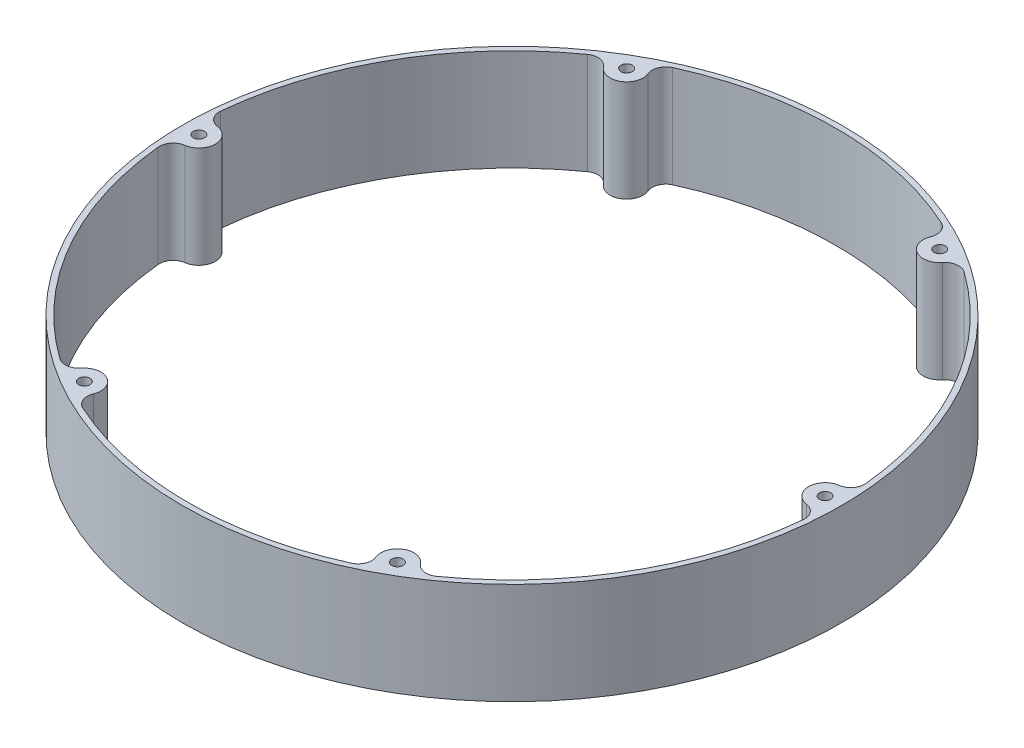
ISO-10303-21;
HEADER;
FILE_DESCRIPTION(('STEP AP214'),'2;1');
FILE_NAME('part.step','',(''),(''),'','','');
FILE_SCHEMA(('AUTOMOTIVE_DESIGN { 1 0 10303 214 1 1 1 1 }'));
ENDSEC;
DATA;
#1=APPLICATION_CONTEXT('core data for automotive mechanical design processes');
#2=APPLICATION_PROTOCOL_DEFINITION('international standard','automotive_design',2000,#1);
#3=PRODUCT_CONTEXT('',#1,'mechanical');
#4=PRODUCT('Part','Part','',(#3));
#5=PRODUCT_RELATED_PRODUCT_CATEGORY('part','',(#4));
#6=PRODUCT_DEFINITION_FORMATION('','',#4);
#7=PRODUCT_DEFINITION_CONTEXT('part definition',#1,'design');
#8=PRODUCT_DEFINITION('design','',#6,#7);
#9=PRODUCT_DEFINITION_SHAPE('','',#8);
#10=(LENGTH_UNIT() NAMED_UNIT(*) SI_UNIT(.MILLI.,.METRE.));
#11=(NAMED_UNIT(*) PLANE_ANGLE_UNIT() SI_UNIT($,.RADIAN.));
#12=(NAMED_UNIT(*) SI_UNIT($,.STERADIAN.) SOLID_ANGLE_UNIT());
#13=UNCERTAINTY_MEASURE_WITH_UNIT(LENGTH_MEASURE(1.E-05),#10,'distance_accuracy_value','');
#14=(GEOMETRIC_REPRESENTATION_CONTEXT(3) GLOBAL_UNCERTAINTY_ASSIGNED_CONTEXT((#13)) GLOBAL_UNIT_ASSIGNED_CONTEXT((#10,
#11,#12)) REPRESENTATION_CONTEXT('',''));
#15=CARTESIAN_POINT('',(0.,0.,0.));
#16=DIRECTION('',(0.,0.,1.));
#17=DIRECTION('',(1.,0.,0.));
#18=AXIS2_PLACEMENT_3D('',#15,#16,#17);
#19=CARTESIAN_POINT('',(0.,18.5,0.));
#20=DIRECTION('',(0.,1.,0.));
#21=DIRECTION('',(0.,0.,1.));
#22=AXIS2_PLACEMENT_3D('',#19,#20,#21);
#23=PLANE('',#22);
#24=CARTESIAN_POINT('',(28.5,18.5,49.363448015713));
#25=DIRECTION('',(0.,-1.,0.));
#26=DIRECTION('',(0.,0.,-1.));
#27=AXIS2_PLACEMENT_3D('',#24,#25,#26);
#28=CIRCLE('',#27,1.02499999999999);
#29=CARTESIAN_POINT('',(28.5,18.5,48.338448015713));
#30=VERTEX_POINT('',#29);
#31=EDGE_CURVE('E480',#30,#30,#28,.T.);
#32=ORIENTED_EDGE('',*,*,#31,.T.);
#33=EDGE_LOOP('',(#32));
#34=FACE_BOUND('',#33,.T.);
#35=CARTESIAN_POINT('',(-28.5,18.5,49.363448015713));
#36=DIRECTION('',(0.,-1.,0.));
#37=DIRECTION('',(0.,0.,-1.));
#38=AXIS2_PLACEMENT_3D('',#35,#36,#37);
#39=CIRCLE('',#38,1.02499999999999);
#40=CARTESIAN_POINT('',(-28.5,18.5,48.338448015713));
#41=VERTEX_POINT('',#40);
#42=EDGE_CURVE('E489',#41,#41,#39,.T.);
#43=ORIENTED_EDGE('',*,*,#42,.T.);
#44=EDGE_LOOP('',(#43));
#45=FACE_BOUND('',#44,.T.);
#46=CARTESIAN_POINT('',(57.,18.5,0.));
#47=DIRECTION('',(0.,-1.,0.));
#48=DIRECTION('',(0.,0.,-1.));
#49=AXIS2_PLACEMENT_3D('',#46,#47,#48);
#50=CIRCLE('',#49,1.025);
#51=CARTESIAN_POINT('',(57.,18.5,-1.02500000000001));
#52=VERTEX_POINT('',#51);
#53=EDGE_CURVE('E513',#52,#52,#50,.T.);
#54=ORIENTED_EDGE('',*,*,#53,.T.);
#55=EDGE_LOOP('',(#54));
#56=FACE_BOUND('',#55,.T.);
#57=CARTESIAN_POINT('',(0.,18.5,0.));
#58=DIRECTION('',(0.,1.,0.));
#59=DIRECTION('',(0.,0.,1.));
#60=AXIS2_PLACEMENT_3D('',#57,#58,#59);
#61=CIRCLE('',#60,60.);
#62=CARTESIAN_POINT('',(0.,18.5,60.));
#63=VERTEX_POINT('',#62);
#64=EDGE_CURVE('E225',#63,#63,#61,.T.);
#65=ORIENTED_EDGE('',*,*,#64,.T.);
#66=EDGE_LOOP('',(#65));
#67=FACE_BOUND('',#66,.T.);
#68=CARTESIAN_POINT('',(0.,18.5,0.));
#69=DIRECTION('',(0.,1.,0.));
#70=DIRECTION('',(0.,0.,1.));
#71=AXIS2_PLACEMENT_3D('',#68,#69,#70);
#72=CIRCLE('',#71,59.);
#73=CARTESIAN_POINT('',(-24.4368153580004,18.5,53.7014157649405));
#74=VERTEX_POINT('',#73);
#75=CARTESIAN_POINT('',(24.4368153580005,18.5,53.7014157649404));
#76=VERTEX_POINT('',#75);
#77=EDGE_CURVE('E361',#74,#76,#72,.T.);
#78=ORIENTED_EDGE('',*,*,#77,.F.);
#79=CARTESIAN_POINT('',(-23.401357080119,18.5,51.4259320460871));
#80=DIRECTION('',(0.,1.,0.));
#81=DIRECTION('',(0.,0.,1.));
#82=AXIS2_PLACEMENT_3D('',#79,#80,#81);
#83=CIRCLE('',#82,2.5);
#84=CARTESIAN_POINT('',(-25.7189220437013,18.5,50.488439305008));
#85=VERTEX_POINT('',#84);
#86=EDGE_CURVE('E60',#74,#85,#83,.F.);
#87=ORIENTED_EDGE('',*,*,#86,.T.);
#88=CARTESIAN_POINT('',(-28.5,18.5,49.363448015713));
#89=DIRECTION('',(0.,1.,0.));
#90=DIRECTION('',(0.,0.,1.));
#91=AXIS2_PLACEMENT_3D('',#88,#89,#90);
#92=CIRCLE('',#91,3.00000000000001);
#93=CARTESIAN_POINT('',(-30.8648100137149,18.5,47.5174595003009));
#94=VERTEX_POINT('',#93);
#95=EDGE_CURVE('E516',#85,#94,#92,.T.);
#96=ORIENTED_EDGE('',*,*,#95,.T.);
#97=CARTESIAN_POINT('',(-32.8354850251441,18.5,45.9791357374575));
#98=DIRECTION('',(0.,1.,0.));
#99=DIRECTION('',(0.,0.,1.));
#100=AXIS2_PLACEMENT_3D('',#97,#98,#99);
#101=CIRCLE('',#100,2.5);
#102=CARTESIAN_POINT('',(-34.2883825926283,18.5,48.0136107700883));
#103=VERTEX_POINT('',#102);
#104=EDGE_CURVE('E52',#94,#103,#101,.F.);
#105=ORIENTED_EDGE('',*,*,#104,.T.);
#106=CARTESIAN_POINT('',(-58.7251979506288,18.5,5.68780499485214));
#107=VERTEX_POINT('',#106);
#108=EDGE_CURVE('E364',#107,#103,#72,.T.);
#109=ORIENTED_EDGE('',*,*,#108,.F.);
#110=CARTESIAN_POINT('',(-56.2368421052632,18.5,5.44679630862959));
#111=DIRECTION('',(0.,1.,0.));
#112=DIRECTION('',(0.,0.,1.));
#113=AXIS2_PLACEMENT_3D('',#110,#111,#112);
#114=CIRCLE('',#113,2.5);
#115=CARTESIAN_POINT('',(-56.5837320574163,18.5,2.97097980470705));
#116=VERTEX_POINT('',#115);
#117=EDGE_CURVE('E288',#107,#116,#114,.F.);
#118=ORIENTED_EDGE('',*,*,#117,.T.);
#119=CARTESIAN_POINT('',(-57.,18.5,0.));
#120=DIRECTION('',(0.,1.,0.));
#121=DIRECTION('',(0.,0.,1.));
#122=AXIS2_PLACEMENT_3D('',#119,#120,#121);
#123=CIRCLE('',#122,3.00000000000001);
#124=CARTESIAN_POINT('',(-56.5837320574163,18.5,-2.97097980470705));
#125=VERTEX_POINT('',#124);
#126=EDGE_CURVE('E222',#116,#125,#123,.T.);
#127=ORIENTED_EDGE('',*,*,#126,.T.);
#128=CARTESIAN_POINT('',(-56.2368421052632,18.5,-5.44679630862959));
#129=DIRECTION('',(0.,1.,0.));
#130=DIRECTION('',(0.,0.,1.));
#131=AXIS2_PLACEMENT_3D('',#128,#129,#130);
#132=CIRCLE('',#131,2.5);
#133=CARTESIAN_POINT('',(-58.7251979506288,18.5,-5.68780499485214));
#134=VERTEX_POINT('',#133);
#135=EDGE_CURVE('E211',#125,#134,#132,.F.);
#136=ORIENTED_EDGE('',*,*,#135,.T.);
#137=CARTESIAN_POINT('',(-34.2883825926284,18.5,-48.0136107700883));
#138=VERTEX_POINT('',#137);
#139=EDGE_CURVE('E372',#138,#134,#72,.T.);
#140=ORIENTED_EDGE('',*,*,#139,.F.);
#141=CARTESIAN_POINT('',(-32.8354850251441,18.5,-45.9791357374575));
#142=DIRECTION('',(0.,1.,0.));
#143=DIRECTION('',(0.,0.,1.));
#144=AXIS2_PLACEMENT_3D('',#141,#142,#143);
#145=CIRCLE('',#144,2.5);
#146=CARTESIAN_POINT('',(-30.864810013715,18.5,-47.5174595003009));
#147=VERTEX_POINT('',#146);
#148=EDGE_CURVE('E292',#138,#147,#145,.F.);
#149=ORIENTED_EDGE('',*,*,#148,.T.);
#150=CARTESIAN_POINT('',(-28.5,18.5,-49.363448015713));
#151=DIRECTION('',(0.,1.,0.));
#152=DIRECTION('',(0.,0.,1.));
#153=AXIS2_PLACEMENT_3D('',#150,#151,#152);
#154=CIRCLE('',#153,3.);
#155=CARTESIAN_POINT('',(-25.7189220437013,18.5,-50.4884393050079));
#156=VERTEX_POINT('',#155);
#157=EDGE_CURVE('E350',#147,#156,#154,.T.);
#158=ORIENTED_EDGE('',*,*,#157,.T.);
#159=CARTESIAN_POINT('',(-23.4013570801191,18.5,-51.425932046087));
#160=DIRECTION('',(0.,1.,0.));
#161=DIRECTION('',(0.,0.,1.));
#162=AXIS2_PLACEMENT_3D('',#159,#160,#161);
#163=CIRCLE('',#162,2.5);
#164=CARTESIAN_POINT('',(-24.4368153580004,18.5,-53.7014157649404));
#165=VERTEX_POINT('',#164);
#166=EDGE_CURVE('E294',#156,#165,#163,.F.);
#167=ORIENTED_EDGE('',*,*,#166,.T.);
#168=CARTESIAN_POINT('',(24.4368153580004,18.5,-53.7014157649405));
#169=VERTEX_POINT('',#168);
#170=EDGE_CURVE('E340',#169,#165,#72,.T.);
#171=ORIENTED_EDGE('',*,*,#170,.F.);
#172=CARTESIAN_POINT('',(23.401357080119,18.5,-51.425932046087));
#173=DIRECTION('',(0.,1.,0.));
#174=DIRECTION('',(0.,0.,1.));
#175=AXIS2_PLACEMENT_3D('',#172,#173,#174);
#176=CIRCLE('',#175,2.5);
#177=CARTESIAN_POINT('',(25.7189220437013,18.5,-50.4884393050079));
#178=VERTEX_POINT('',#177);
#179=EDGE_CURVE('E300',#169,#178,#176,.F.);
#180=ORIENTED_EDGE('',*,*,#179,.T.);
#181=CARTESIAN_POINT('',(28.5,18.5,-49.363448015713));
#182=DIRECTION('',(0.,1.,0.));
#183=DIRECTION('',(0.,0.,1.));
#184=AXIS2_PLACEMENT_3D('',#181,#182,#183);
#185=CIRCLE('',#184,3.);
#186=CARTESIAN_POINT('',(30.864810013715,18.5,-47.5174595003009));
#187=VERTEX_POINT('',#186);
#188=EDGE_CURVE('E330',#178,#187,#185,.T.);
#189=ORIENTED_EDGE('',*,*,#188,.T.);
#190=CARTESIAN_POINT('',(32.8354850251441,18.5,-45.9791357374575));
#191=DIRECTION('',(0.,1.,0.));
#192=DIRECTION('',(0.,0.,1.));
#193=AXIS2_PLACEMENT_3D('',#190,#191,#192);
#194=CIRCLE('',#193,2.5);
#195=CARTESIAN_POINT('',(34.2883825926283,18.5,-48.0136107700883));
#196=VERTEX_POINT('',#195);
#197=EDGE_CURVE('E45',#187,#196,#194,.F.);
#198=ORIENTED_EDGE('',*,*,#197,.T.);
#199=CARTESIAN_POINT('',(58.7251979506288,18.5,-5.68780499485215));
#200=VERTEX_POINT('',#199);
#201=EDGE_CURVE('E327',#200,#196,#72,.T.);
#202=ORIENTED_EDGE('',*,*,#201,.F.);
#203=CARTESIAN_POINT('',(56.2368421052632,18.5,-5.4467963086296));
#204=DIRECTION('',(0.,1.,0.));
#205=DIRECTION('',(0.,0.,1.));
#206=AXIS2_PLACEMENT_3D('',#203,#204,#205);
#207=CIRCLE('',#206,2.5);
#208=CARTESIAN_POINT('',(56.5837320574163,18.5,-2.97097980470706));
#209=VERTEX_POINT('',#208);
#210=EDGE_CURVE('E304',#200,#209,#207,.F.);
#211=ORIENTED_EDGE('',*,*,#210,.T.);
#212=CARTESIAN_POINT('',(57.,18.5,0.));
#213=DIRECTION('',(0.,1.,0.));
#214=DIRECTION('',(0.,0.,1.));
#215=AXIS2_PLACEMENT_3D('',#212,#213,#214);
#216=CIRCLE('',#215,3.00000000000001);
#217=CARTESIAN_POINT('',(56.5837320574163,18.5,2.97097980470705));
#218=VERTEX_POINT('',#217);
#219=EDGE_CURVE('E527',#209,#218,#216,.T.);
#220=ORIENTED_EDGE('',*,*,#219,.T.);
#221=CARTESIAN_POINT('',(56.2368421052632,18.5,5.44679630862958));
#222=DIRECTION('',(0.,1.,0.));
#223=DIRECTION('',(0.,0.,1.));
#224=AXIS2_PLACEMENT_3D('',#221,#222,#223);
#225=CIRCLE('',#224,2.5);
#226=CARTESIAN_POINT('',(58.7251979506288,18.5,5.68780499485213));
#227=VERTEX_POINT('',#226);
#228=EDGE_CURVE('E306',#218,#227,#225,.F.);
#229=ORIENTED_EDGE('',*,*,#228,.T.);
#230=CARTESIAN_POINT('',(34.2883825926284,18.5,48.0136107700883));
#231=VERTEX_POINT('',#230);
#232=EDGE_CURVE('E339',#231,#227,#72,.T.);
#233=ORIENTED_EDGE('',*,*,#232,.F.);
#234=CARTESIAN_POINT('',(32.8354850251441,18.5,45.9791357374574));
#235=DIRECTION('',(0.,1.,0.));
#236=DIRECTION('',(0.,0.,1.));
#237=AXIS2_PLACEMENT_3D('',#234,#235,#236);
#238=CIRCLE('',#237,2.5);
#239=CARTESIAN_POINT('',(30.864810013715,18.5,47.5174595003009));
#240=VERTEX_POINT('',#239);
#241=EDGE_CURVE('E312',#231,#240,#238,.F.);
#242=ORIENTED_EDGE('',*,*,#241,.T.);
#243=CARTESIAN_POINT('',(28.5,18.5,49.363448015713));
#244=DIRECTION('',(0.,1.,0.));
#245=DIRECTION('',(0.,0.,1.));
#246=AXIS2_PLACEMENT_3D('',#243,#244,#245);
#247=CIRCLE('',#246,3.);
#248=CARTESIAN_POINT('',(25.7189220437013,18.5,50.4884393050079));
#249=VERTEX_POINT('',#248);
#250=EDGE_CURVE('E521',#240,#249,#247,.T.);
#251=ORIENTED_EDGE('',*,*,#250,.T.);
#252=CARTESIAN_POINT('',(23.4013570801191,18.5,51.425932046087));
#253=DIRECTION('',(0.,1.,0.));
#254=DIRECTION('',(0.,0.,1.));
#255=AXIS2_PLACEMENT_3D('',#252,#253,#254);
#256=CIRCLE('',#255,2.5);
#257=EDGE_CURVE('E314',#249,#76,#256,.F.);
#258=ORIENTED_EDGE('',*,*,#257,.T.);
#259=EDGE_LOOP('',(#78,#87,#96,#105,#109,#118,#127,#136,#140,#149,#158,#167,#171,#180,#189,#198,
#202,#211,#220,#229,#233,#242,#251,#258));
#260=FACE_BOUND('',#259,.T.);
#261=CARTESIAN_POINT('',(28.5,18.5,-49.363448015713));
#262=DIRECTION('',(0.,-1.,0.));
#263=DIRECTION('',(0.,0.,-1.));
#264=AXIS2_PLACEMENT_3D('',#261,#262,#263);
#265=CIRCLE('',#264,1.02499999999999);
#266=CARTESIAN_POINT('',(28.5,18.5,-50.388448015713));
#267=VERTEX_POINT('',#266);
#268=EDGE_CURVE('E507',#267,#267,#265,.T.);
#269=ORIENTED_EDGE('',*,*,#268,.T.);
#270=EDGE_LOOP('',(#269));
#271=FACE_BOUND('',#270,.T.);
#272=CARTESIAN_POINT('',(-28.5,18.5,-49.363448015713));
#273=DIRECTION('',(0.,-1.,0.));
#274=DIRECTION('',(0.,0.,-1.));
#275=AXIS2_PLACEMENT_3D('',#272,#273,#274);
#276=CIRCLE('',#275,1.02499999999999);
#277=CARTESIAN_POINT('',(-28.5,18.5,-50.388448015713));
#278=VERTEX_POINT('',#277);
#279=EDGE_CURVE('E501',#278,#278,#276,.T.);
#280=ORIENTED_EDGE('',*,*,#279,.T.);
#281=EDGE_LOOP('',(#280));
#282=FACE_BOUND('',#281,.T.);
#283=CARTESIAN_POINT('',(-57.,18.5,0.));
#284=DIRECTION('',(0.,-1.,0.));
#285=DIRECTION('',(0.,0.,-1.));
#286=AXIS2_PLACEMENT_3D('',#283,#284,#285);
#287=CIRCLE('',#286,1.025);
#288=CARTESIAN_POINT('',(-57.,18.5,-1.025));
#289=VERTEX_POINT('',#288);
#290=EDGE_CURVE('E495',#289,#289,#287,.T.);
#291=ORIENTED_EDGE('',*,*,#290,.T.);
#292=EDGE_LOOP('',(#291));
#293=FACE_BOUND('',#292,.T.);
#294=ADVANCED_FACE('F37',(#34,#45,#56,#67,#260,#271,#282,#293),#23,.T.);
#295=CARTESIAN_POINT('',(0.,18.5,0.));
#296=DIRECTION('',(0.,-1.,0.));
#297=DIRECTION('',(0.,0.,-1.));
#298=AXIS2_PLACEMENT_3D('',#295,#296,#297);
#299=CYLINDRICAL_SURFACE('',#298,59.);
#300=CARTESIAN_POINT('',(0.,0.,0.));
#301=DIRECTION('',(0.,1.,0.));
#302=DIRECTION('',(0.,0.,1.));
#303=AXIS2_PLACEMENT_3D('',#300,#301,#302);
#304=CIRCLE('',#303,59.);
#305=CARTESIAN_POINT('',(-58.7251979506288,0.,5.68780499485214));
#306=VERTEX_POINT('',#305);
#307=CARTESIAN_POINT('',(-34.2883825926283,0.,48.0136107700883));
#308=VERTEX_POINT('',#307);
#309=EDGE_CURVE('E367',#306,#308,#304,.T.);
#310=ORIENTED_EDGE('',*,*,#309,.F.);
#311=DIRECTION('',(0.,-1.,0.));
#312=VECTOR('',#311,1.);
#313=CARTESIAN_POINT('',(-58.7251979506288,18.5,5.68780499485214));
#314=LINE('',#313,#312);
#315=EDGE_CURVE('E235',#306,#107,#314,.F.);
#316=ORIENTED_EDGE('',*,*,#315,.T.);
#317=ORIENTED_EDGE('',*,*,#108,.T.);
#318=DIRECTION('',(0.,-1.,0.));
#319=VECTOR('',#318,1.);
#320=CARTESIAN_POINT('',(-34.2883825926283,18.5,48.0136107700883));
#321=LINE('',#320,#319);
#322=EDGE_CURVE('E227',#103,#308,#321,.T.);
#323=ORIENTED_EDGE('',*,*,#322,.T.);
#324=EDGE_LOOP('',(#310,#316,#317,#323));
#325=FACE_BOUND('',#324,.T.);
#326=ADVANCED_FACE('F424',(#325),#299,.F.);
#327=ORIENTED_EDGE('',*,*,#77,.T.);
#328=DIRECTION('',(0.,-1.,0.));
#329=VECTOR('',#328,1.);
#330=CARTESIAN_POINT('',(24.4368153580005,18.5,53.7014157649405));
#331=LINE('',#330,#329);
#332=CARTESIAN_POINT('',(24.4368153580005,0.,53.7014157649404));
#333=VERTEX_POINT('',#332);
#334=EDGE_CURVE('E279',#76,#333,#331,.T.);
#335=ORIENTED_EDGE('',*,*,#334,.T.);
#336=CARTESIAN_POINT('',(-24.4368153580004,0.,53.7014157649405));
#337=VERTEX_POINT('',#336);
#338=EDGE_CURVE('E365',#337,#333,#304,.T.);
#339=ORIENTED_EDGE('',*,*,#338,.F.);
#340=DIRECTION('',(0.,-1.,0.));
#341=VECTOR('',#340,1.);
#342=CARTESIAN_POINT('',(-24.4368153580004,18.5,53.7014157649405));
#343=LINE('',#342,#341);
#344=EDGE_CURVE('E277',#337,#74,#343,.F.);
#345=ORIENTED_EDGE('',*,*,#344,.T.);
#346=EDGE_LOOP('',(#327,#335,#339,#345));
#347=FACE_BOUND('',#346,.T.);
#348=ADVANCED_FACE('F429',(#347),#299,.F.);
#349=ORIENTED_EDGE('',*,*,#232,.T.);
#350=DIRECTION('',(0.,-1.,0.));
#351=VECTOR('',#350,1.);
#352=CARTESIAN_POINT('',(58.7251979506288,18.5,5.68780499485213));
#353=LINE('',#352,#351);
#354=CARTESIAN_POINT('',(58.7251979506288,0.,5.68780499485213));
#355=VERTEX_POINT('',#354);
#356=EDGE_CURVE('E269',#227,#355,#353,.T.);
#357=ORIENTED_EDGE('',*,*,#356,.T.);
#358=CARTESIAN_POINT('',(34.2883825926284,0.,48.0136107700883));
#359=VERTEX_POINT('',#358);
#360=EDGE_CURVE('E368',#359,#355,#304,.T.);
#361=ORIENTED_EDGE('',*,*,#360,.F.);
#362=DIRECTION('',(0.,-1.,0.));
#363=VECTOR('',#362,1.);
#364=CARTESIAN_POINT('',(34.2883825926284,18.5,48.0136107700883));
#365=LINE('',#364,#363);
#366=EDGE_CURVE('E267',#359,#231,#365,.F.);
#367=ORIENTED_EDGE('',*,*,#366,.T.);
#368=EDGE_LOOP('',(#349,#357,#361,#367));
#369=FACE_BOUND('',#368,.T.);
#370=ADVANCED_FACE('F541',(#369),#299,.F.);
#371=CARTESIAN_POINT('',(58.7251979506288,0.,-5.68780499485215));
#372=VERTEX_POINT('',#371);
#373=CARTESIAN_POINT('',(34.2883825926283,0.,-48.0136107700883));
#374=VERTEX_POINT('',#373);
#375=EDGE_CURVE('E346',#372,#374,#304,.T.);
#376=ORIENTED_EDGE('',*,*,#375,.F.);
#377=DIRECTION('',(0.,-1.,0.));
#378=VECTOR('',#377,1.);
#379=CARTESIAN_POINT('',(58.7251979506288,18.5,-5.68780499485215));
#380=LINE('',#379,#378);
#381=EDGE_CURVE('E265',#372,#200,#380,.F.);
#382=ORIENTED_EDGE('',*,*,#381,.T.);
#383=ORIENTED_EDGE('',*,*,#201,.T.);
#384=DIRECTION('',(0.,-1.,0.));
#385=VECTOR('',#384,1.);
#386=CARTESIAN_POINT('',(34.2883825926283,18.5,-48.0136107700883));
#387=LINE('',#386,#385);
#388=EDGE_CURVE('E263',#196,#374,#387,.T.);
#389=ORIENTED_EDGE('',*,*,#388,.T.);
#390=EDGE_LOOP('',(#376,#382,#383,#389));
#391=FACE_BOUND('',#390,.T.);
#392=ADVANCED_FACE('F336',(#391),#299,.F.);
#393=ORIENTED_EDGE('',*,*,#170,.T.);
#394=DIRECTION('',(0.,-1.,0.));
#395=VECTOR('',#394,1.);
#396=CARTESIAN_POINT('',(-24.4368153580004,18.5,-53.7014157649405));
#397=LINE('',#396,#395);
#398=CARTESIAN_POINT('',(-24.4368153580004,0.,-53.7014157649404));
#399=VERTEX_POINT('',#398);
#400=EDGE_CURVE('E249',#165,#399,#397,.T.);
#401=ORIENTED_EDGE('',*,*,#400,.T.);
#402=CARTESIAN_POINT('',(24.4368153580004,0.,-53.7014157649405));
#403=VERTEX_POINT('',#402);
#404=EDGE_CURVE('E376',#403,#399,#304,.T.);
#405=ORIENTED_EDGE('',*,*,#404,.F.);
#406=DIRECTION('',(0.,-1.,0.));
#407=VECTOR('',#406,1.);
#408=CARTESIAN_POINT('',(24.4368153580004,18.5,-53.7014157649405));
#409=LINE('',#408,#407);
#410=EDGE_CURVE('E247',#403,#169,#409,.F.);
#411=ORIENTED_EDGE('',*,*,#410,.T.);
#412=EDGE_LOOP('',(#393,#401,#405,#411));
#413=FACE_BOUND('',#412,.T.);
#414=ADVANCED_FACE('F410',(#413),#299,.F.);
#415=CARTESIAN_POINT('',(0.,0.,0.));
#416=DIRECTION('',(0.,1.,0.));
#417=DIRECTION('',(0.,0.,1.));
#418=AXIS2_PLACEMENT_3D('',#415,#416,#417);
#419=PLANE('',#418);
#420=CARTESIAN_POINT('',(28.5,0.,49.363448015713));
#421=DIRECTION('',(0.,-1.,0.));
#422=DIRECTION('',(0.,0.,-1.));
#423=AXIS2_PLACEMENT_3D('',#420,#421,#422);
#424=CIRCLE('',#423,1.025);
#425=CARTESIAN_POINT('',(28.5,0.,48.338448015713));
#426=VERTEX_POINT('',#425);
#427=EDGE_CURVE('E482',#426,#426,#424,.T.);
#428=ORIENTED_EDGE('',*,*,#427,.F.);
#429=EDGE_LOOP('',(#428));
#430=FACE_BOUND('',#429,.T.);
#431=CARTESIAN_POINT('',(-28.5,0.,49.363448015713));
#432=DIRECTION('',(0.,-1.,0.));
#433=DIRECTION('',(0.,0.,-1.));
#434=AXIS2_PLACEMENT_3D('',#431,#432,#433);
#435=CIRCLE('',#434,1.025);
#436=CARTESIAN_POINT('',(-28.5,0.,48.338448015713));
#437=VERTEX_POINT('',#436);
#438=EDGE_CURVE('E484',#437,#437,#435,.T.);
#439=ORIENTED_EDGE('',*,*,#438,.F.);
#440=EDGE_LOOP('',(#439));
#441=FACE_BOUND('',#440,.T.);
#442=CARTESIAN_POINT('',(-57.,0.,0.));
#443=DIRECTION('',(0.,-1.,0.));
#444=DIRECTION('',(0.,0.,-1.));
#445=AXIS2_PLACEMENT_3D('',#442,#443,#444);
#446=CIRCLE('',#445,1.025);
#447=CARTESIAN_POINT('',(-57.,0.,-1.025));
#448=VERTEX_POINT('',#447);
#449=EDGE_CURVE('E492',#448,#448,#446,.T.);
#450=ORIENTED_EDGE('',*,*,#449,.F.);
#451=EDGE_LOOP('',(#450));
#452=FACE_BOUND('',#451,.T.);
#453=CARTESIAN_POINT('',(-28.5,0.,-49.363448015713));
#454=DIRECTION('',(0.,-1.,0.));
#455=DIRECTION('',(0.,0.,-1.));
#456=AXIS2_PLACEMENT_3D('',#453,#454,#455);
#457=CIRCLE('',#456,1.025);
#458=CARTESIAN_POINT('',(-28.5,0.,-50.388448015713));
#459=VERTEX_POINT('',#458);
#460=EDGE_CURVE('E498',#459,#459,#457,.T.);
#461=ORIENTED_EDGE('',*,*,#460,.F.);
#462=EDGE_LOOP('',(#461));
#463=FACE_BOUND('',#462,.T.);
#464=CARTESIAN_POINT('',(28.5,0.,-49.363448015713));
#465=DIRECTION('',(0.,-1.,0.));
#466=DIRECTION('',(0.,0.,-1.));
#467=AXIS2_PLACEMENT_3D('',#464,#465,#466);
#468=CIRCLE('',#467,1.025);
#469=CARTESIAN_POINT('',(28.5,0.,-50.388448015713));
#470=VERTEX_POINT('',#469);
#471=EDGE_CURVE('E504',#470,#470,#468,.T.);
#472=ORIENTED_EDGE('',*,*,#471,.F.);
#473=EDGE_LOOP('',(#472));
#474=FACE_BOUND('',#473,.T.);
#475=CARTESIAN_POINT('',(57.,0.,0.));
#476=DIRECTION('',(0.,-1.,0.));
#477=DIRECTION('',(0.,0.,-1.));
#478=AXIS2_PLACEMENT_3D('',#475,#476,#477);
#479=CIRCLE('',#478,1.025);
#480=CARTESIAN_POINT('',(57.,0.,-1.02500000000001));
#481=VERTEX_POINT('',#480);
#482=EDGE_CURVE('E510',#481,#481,#479,.T.);
#483=ORIENTED_EDGE('',*,*,#482,.F.);
#484=EDGE_LOOP('',(#483));
#485=FACE_BOUND('',#484,.T.);
#486=CARTESIAN_POINT('',(0.,0.,0.));
#487=DIRECTION('',(0.,1.,0.));
#488=DIRECTION('',(0.,0.,1.));
#489=AXIS2_PLACEMENT_3D('',#486,#487,#488);
#490=CIRCLE('',#489,60.);
#491=CARTESIAN_POINT('',(0.,0.,60.));
#492=VERTEX_POINT('',#491);
#493=EDGE_CURVE('E230',#492,#492,#490,.T.);
#494=ORIENTED_EDGE('',*,*,#493,.F.);
#495=EDGE_LOOP('',(#494));
#496=FACE_BOUND('',#495,.T.);
#497=CARTESIAN_POINT('',(-57.,0.,0.));
#498=DIRECTION('',(0.,1.,0.));
#499=DIRECTION('',(0.,0.,1.));
#500=AXIS2_PLACEMENT_3D('',#497,#498,#499);
#501=CIRCLE('',#500,3.00000000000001);
#502=CARTESIAN_POINT('',(-56.5837320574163,0.,-2.97097980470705));
#503=VERTEX_POINT('',#502);
#504=CARTESIAN_POINT('',(-56.5837320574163,0.,2.97097980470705));
#505=VERTEX_POINT('',#504);
#506=EDGE_CURVE('E204',#503,#505,#501,.F.);
#507=ORIENTED_EDGE('',*,*,#506,.T.);
#508=CARTESIAN_POINT('',(-56.2368421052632,0.,5.44679630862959));
#509=DIRECTION('',(0.,1.,0.));
#510=DIRECTION('',(0.,0.,1.));
#511=AXIS2_PLACEMENT_3D('',#508,#509,#510);
#512=CIRCLE('',#511,2.5);
#513=EDGE_CURVE('E286',#505,#306,#512,.T.);
#514=ORIENTED_EDGE('',*,*,#513,.T.);
#515=ORIENTED_EDGE('',*,*,#309,.T.);
#516=CARTESIAN_POINT('',(-32.8354850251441,0.,45.9791357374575));
#517=DIRECTION('',(0.,1.,0.));
#518=DIRECTION('',(0.,0.,1.));
#519=AXIS2_PLACEMENT_3D('',#516,#517,#518);
#520=CIRCLE('',#519,2.5);
#521=CARTESIAN_POINT('',(-30.8648100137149,0.,47.5174595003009));
#522=VERTEX_POINT('',#521);
#523=EDGE_CURVE('E322',#308,#522,#520,.T.);
#524=ORIENTED_EDGE('',*,*,#523,.T.);
#525=CARTESIAN_POINT('',(-28.5,0.,49.363448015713));
#526=DIRECTION('',(0.,1.,0.));
#527=DIRECTION('',(0.,0.,1.));
#528=AXIS2_PLACEMENT_3D('',#525,#526,#527);
#529=CIRCLE('',#528,3.00000000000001);
#530=CARTESIAN_POINT('',(-25.7189220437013,0.,50.488439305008));
#531=VERTEX_POINT('',#530);
#532=EDGE_CURVE('E518',#522,#531,#529,.F.);
#533=ORIENTED_EDGE('',*,*,#532,.T.);
#534=CARTESIAN_POINT('',(-23.401357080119,0.,51.4259320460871));
#535=DIRECTION('',(0.,1.,0.));
#536=DIRECTION('',(0.,0.,1.));
#537=AXIS2_PLACEMENT_3D('',#534,#535,#536);
#538=CIRCLE('',#537,2.5);
#539=EDGE_CURVE('E318',#531,#337,#538,.T.);
#540=ORIENTED_EDGE('',*,*,#539,.T.);
#541=ORIENTED_EDGE('',*,*,#338,.T.);
#542=CARTESIAN_POINT('',(23.4013570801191,0.,51.425932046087));
#543=DIRECTION('',(0.,1.,0.));
#544=DIRECTION('',(0.,0.,1.));
#545=AXIS2_PLACEMENT_3D('',#542,#543,#544);
#546=CIRCLE('',#545,2.5);
#547=CARTESIAN_POINT('',(25.7189220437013,0.,50.4884393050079));
#548=VERTEX_POINT('',#547);
#549=EDGE_CURVE('E316',#333,#548,#546,.T.);
#550=ORIENTED_EDGE('',*,*,#549,.T.);
#551=CARTESIAN_POINT('',(28.5,0.,49.363448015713));
#552=DIRECTION('',(0.,1.,0.));
#553=DIRECTION('',(0.,0.,1.));
#554=AXIS2_PLACEMENT_3D('',#551,#552,#553);
#555=CIRCLE('',#554,3.);
#556=CARTESIAN_POINT('',(30.864810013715,0.,47.5174595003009));
#557=VERTEX_POINT('',#556);
#558=EDGE_CURVE('E524',#548,#557,#555,.F.);
#559=ORIENTED_EDGE('',*,*,#558,.T.);
#560=CARTESIAN_POINT('',(32.8354850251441,0.,45.9791357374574));
#561=DIRECTION('',(0.,1.,0.));
#562=DIRECTION('',(0.,0.,1.));
#563=AXIS2_PLACEMENT_3D('',#560,#561,#562);
#564=CIRCLE('',#563,2.5);
#565=EDGE_CURVE('E310',#557,#359,#564,.T.);
#566=ORIENTED_EDGE('',*,*,#565,.T.);
#567=ORIENTED_EDGE('',*,*,#360,.T.);
#568=CARTESIAN_POINT('',(56.2368421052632,0.,5.44679630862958));
#569=DIRECTION('',(0.,1.,0.));
#570=DIRECTION('',(0.,0.,1.));
#571=AXIS2_PLACEMENT_3D('',#568,#569,#570);
#572=CIRCLE('',#571,2.5);
#573=CARTESIAN_POINT('',(56.5837320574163,0.,2.97097980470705));
#574=VERTEX_POINT('',#573);
#575=EDGE_CURVE('E308',#355,#574,#572,.T.);
#576=ORIENTED_EDGE('',*,*,#575,.T.);
#577=CARTESIAN_POINT('',(57.,0.,0.));
#578=DIRECTION('',(0.,1.,0.));
#579=DIRECTION('',(0.,0.,1.));
#580=AXIS2_PLACEMENT_3D('',#577,#578,#579);
#581=CIRCLE('',#580,3.00000000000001);
#582=CARTESIAN_POINT('',(56.5837320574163,0.,-2.97097980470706));
#583=VERTEX_POINT('',#582);
#584=EDGE_CURVE('E355',#574,#583,#581,.F.);
#585=ORIENTED_EDGE('',*,*,#584,.T.);
#586=CARTESIAN_POINT('',(56.2368421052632,0.,-5.4467963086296));
#587=DIRECTION('',(0.,1.,0.));
#588=DIRECTION('',(0.,0.,1.));
#589=AXIS2_PLACEMENT_3D('',#586,#587,#588);
#590=CIRCLE('',#589,2.5);
#591=EDGE_CURVE('E302',#583,#372,#590,.T.);
#592=ORIENTED_EDGE('',*,*,#591,.T.);
#593=ORIENTED_EDGE('',*,*,#375,.T.);
#594=CARTESIAN_POINT('',(32.8354850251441,0.,-45.9791357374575));
#595=DIRECTION('',(0.,1.,0.));
#596=DIRECTION('',(0.,0.,1.));
#597=AXIS2_PLACEMENT_3D('',#594,#595,#596);
#598=CIRCLE('',#597,2.5);
#599=CARTESIAN_POINT('',(30.864810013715,0.,-47.5174595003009));
#600=VERTEX_POINT('',#599);
#601=EDGE_CURVE('E11',#374,#600,#598,.T.);
#602=ORIENTED_EDGE('',*,*,#601,.T.);
#603=CARTESIAN_POINT('',(28.5,0.,-49.363448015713));
#604=DIRECTION('',(0.,1.,0.));
#605=DIRECTION('',(0.,0.,1.));
#606=AXIS2_PLACEMENT_3D('',#603,#604,#605);
#607=CIRCLE('',#606,3.);
#608=CARTESIAN_POINT('',(25.7189220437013,0.,-50.4884393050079));
#609=VERTEX_POINT('',#608);
#610=EDGE_CURVE('E345',#600,#609,#607,.F.);
#611=ORIENTED_EDGE('',*,*,#610,.T.);
#612=CARTESIAN_POINT('',(23.401357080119,0.,-51.425932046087));
#613=DIRECTION('',(0.,1.,0.));
#614=DIRECTION('',(0.,0.,1.));
#615=AXIS2_PLACEMENT_3D('',#612,#613,#614);
#616=CIRCLE('',#615,2.5);
#617=EDGE_CURVE('E298',#609,#403,#616,.T.);
#618=ORIENTED_EDGE('',*,*,#617,.T.);
#619=ORIENTED_EDGE('',*,*,#404,.T.);
#620=CARTESIAN_POINT('',(-23.4013570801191,0.,-51.425932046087));
#621=DIRECTION('',(0.,1.,0.));
#622=DIRECTION('',(0.,0.,1.));
#623=AXIS2_PLACEMENT_3D('',#620,#621,#622);
#624=CIRCLE('',#623,2.5);
#625=CARTESIAN_POINT('',(-25.7189220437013,0.,-50.4884393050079));
#626=VERTEX_POINT('',#625);
#627=EDGE_CURVE('E296',#399,#626,#624,.T.);
#628=ORIENTED_EDGE('',*,*,#627,.T.);
#629=CARTESIAN_POINT('',(-28.5,0.,-49.363448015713));
#630=DIRECTION('',(0.,1.,0.));
#631=DIRECTION('',(0.,0.,1.));
#632=AXIS2_PLACEMENT_3D('',#629,#630,#631);
#633=CIRCLE('',#632,3.);
#634=CARTESIAN_POINT('',(-30.864810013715,0.,-47.5174595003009));
#635=VERTEX_POINT('',#634);
#636=EDGE_CURVE('E353',#626,#635,#633,.F.);
#637=ORIENTED_EDGE('',*,*,#636,.T.);
#638=CARTESIAN_POINT('',(-32.8354850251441,0.,-45.9791357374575));
#639=DIRECTION('',(0.,1.,0.));
#640=DIRECTION('',(0.,0.,1.));
#641=AXIS2_PLACEMENT_3D('',#638,#639,#640);
#642=CIRCLE('',#641,2.5);
#643=CARTESIAN_POINT('',(-34.2883825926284,0.,-48.0136107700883));
#644=VERTEX_POINT('',#643);
#645=EDGE_CURVE('E210',#635,#644,#642,.T.);
#646=ORIENTED_EDGE('',*,*,#645,.T.);
#647=CARTESIAN_POINT('',(-58.7251979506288,0.,-5.68780499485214));
#648=VERTEX_POINT('',#647);
#649=EDGE_CURVE('E206',#644,#648,#304,.T.);
#650=ORIENTED_EDGE('',*,*,#649,.T.);
#651=CARTESIAN_POINT('',(-56.2368421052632,0.,-5.44679630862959));
#652=DIRECTION('',(0.,1.,0.));
#653=DIRECTION('',(0.,0.,1.));
#654=AXIS2_PLACEMENT_3D('',#651,#652,#653);
#655=CIRCLE('',#654,2.5);
#656=EDGE_CURVE('E201',#648,#503,#655,.T.);
#657=ORIENTED_EDGE('',*,*,#656,.T.);
#658=EDGE_LOOP('',(#507,#514,#515,#524,#533,#540,#541,#550,#559,#566,#567,#576,#585,#592,#593,
#602,#611,#618,#619,#628,#637,#646,#650,#657));
#659=FACE_BOUND('',#658,.T.);
#660=ADVANCED_FACE('F203',(#430,#441,#452,#463,#474,#485,#496,#659),#419,.F.);
#661=CARTESIAN_POINT('',(0.,18.5,0.));
#662=DIRECTION('',(0.,-1.,0.));
#663=DIRECTION('',(0.,0.,-1.));
#664=AXIS2_PLACEMENT_3D('',#661,#662,#663);
#665=CYLINDRICAL_SURFACE('',#664,60.);
#666=ORIENTED_EDGE('',*,*,#64,.F.);
#667=EDGE_LOOP('',(#666));
#668=FACE_BOUND('',#667,.T.);
#669=ORIENTED_EDGE('',*,*,#493,.T.);
#670=EDGE_LOOP('',(#669));
#671=FACE_BOUND('',#670,.T.);
#672=ADVANCED_FACE('F407',(#668,#671),#665,.T.);
#673=ORIENTED_EDGE('',*,*,#139,.T.);
#674=DIRECTION('',(0.,-1.,0.));
#675=VECTOR('',#674,1.);
#676=CARTESIAN_POINT('',(-58.7251979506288,18.5,-5.68780499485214));
#677=LINE('',#676,#675);
#678=EDGE_CURVE('E239',#134,#648,#677,.T.);
#679=ORIENTED_EDGE('',*,*,#678,.T.);
#680=ORIENTED_EDGE('',*,*,#649,.F.);
#681=DIRECTION('',(0.,-1.,0.));
#682=VECTOR('',#681,1.);
#683=CARTESIAN_POINT('',(-34.2883825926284,18.5,-48.0136107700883));
#684=LINE('',#683,#682);
#685=EDGE_CURVE('E237',#644,#138,#684,.F.);
#686=ORIENTED_EDGE('',*,*,#685,.T.);
#687=EDGE_LOOP('',(#673,#679,#680,#686));
#688=FACE_BOUND('',#687,.T.);
#689=ADVANCED_FACE('F400',(#688),#299,.F.);
#690=CARTESIAN_POINT('',(-57.,-8.4852813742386,0.));
#691=DIRECTION('',(0.,1.,0.));
#692=DIRECTION('',(0.,0.,1.));
#693=AXIS2_PLACEMENT_3D('',#690,#691,#692);
#694=CYLINDRICAL_SURFACE('',#693,3.00000000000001);
#695=ORIENTED_EDGE('',*,*,#126,.F.);
#696=DIRECTION('',(0.,1.,0.));
#697=VECTOR('',#696,1.);
#698=CARTESIAN_POINT('',(-56.5837320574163,-8.4852813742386,2.97097980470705));
#699=LINE('',#698,#697);
#700=EDGE_CURVE('E221',#116,#505,#699,.F.);
#701=ORIENTED_EDGE('',*,*,#700,.T.);
#702=ORIENTED_EDGE('',*,*,#506,.F.);
#703=DIRECTION('',(0.,1.,0.));
#704=VECTOR('',#703,1.);
#705=CARTESIAN_POINT('',(-56.5837320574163,-8.4852813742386,-2.97097980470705));
#706=LINE('',#705,#704);
#707=EDGE_CURVE('E218',#503,#125,#706,.T.);
#708=ORIENTED_EDGE('',*,*,#707,.T.);
#709=EDGE_LOOP('',(#695,#701,#702,#708));
#710=FACE_BOUND('',#709,.T.);
#711=ADVANCED_FACE('F217',(#710),#694,.T.);
#712=CARTESIAN_POINT('',(-28.5,-8.4852813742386,-49.363448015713));
#713=DIRECTION('',(0.,1.,0.));
#714=DIRECTION('',(0.,0.,1.));
#715=AXIS2_PLACEMENT_3D('',#712,#713,#714);
#716=CYLINDRICAL_SURFACE('',#715,3.);
#717=ORIENTED_EDGE('',*,*,#157,.F.);
#718=DIRECTION('',(0.,1.,0.));
#719=VECTOR('',#718,1.);
#720=CARTESIAN_POINT('',(-30.864810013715,-8.4852813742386,-47.5174595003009));
#721=LINE('',#720,#719);
#722=EDGE_CURVE('E244',#147,#635,#721,.F.);
#723=ORIENTED_EDGE('',*,*,#722,.T.);
#724=ORIENTED_EDGE('',*,*,#636,.F.);
#725=DIRECTION('',(0.,1.,0.));
#726=VECTOR('',#725,1.);
#727=CARTESIAN_POINT('',(-25.7189220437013,-8.4852813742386,-50.4884393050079));
#728=LINE('',#727,#726);
#729=EDGE_CURVE('E241',#626,#156,#728,.T.);
#730=ORIENTED_EDGE('',*,*,#729,.T.);
#731=EDGE_LOOP('',(#717,#723,#724,#730));
#732=FACE_BOUND('',#731,.T.);
#733=ADVANCED_FACE('F389',(#732),#716,.T.);
#734=CARTESIAN_POINT('',(28.5,-8.4852813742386,-49.363448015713));
#735=DIRECTION('',(0.,1.,0.));
#736=DIRECTION('',(0.,0.,1.));
#737=AXIS2_PLACEMENT_3D('',#734,#735,#736);
#738=CYLINDRICAL_SURFACE('',#737,3.);
#739=ORIENTED_EDGE('',*,*,#188,.F.);
#740=DIRECTION('',(0.,1.,0.));
#741=VECTOR('',#740,1.);
#742=CARTESIAN_POINT('',(25.7189220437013,-8.4852813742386,-50.4884393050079));
#743=LINE('',#742,#741);
#744=EDGE_CURVE('E254',#178,#609,#743,.F.);
#745=ORIENTED_EDGE('',*,*,#744,.T.);
#746=ORIENTED_EDGE('',*,*,#610,.F.);
#747=DIRECTION('',(0.,1.,0.));
#748=VECTOR('',#747,1.);
#749=CARTESIAN_POINT('',(30.864810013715,-8.4852813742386,-47.5174595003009));
#750=LINE('',#749,#748);
#751=EDGE_CURVE('E251',#600,#187,#750,.T.);
#752=ORIENTED_EDGE('',*,*,#751,.T.);
#753=EDGE_LOOP('',(#739,#745,#746,#752));
#754=FACE_BOUND('',#753,.T.);
#755=ADVANCED_FACE('F348',(#754),#738,.T.);
#756=CARTESIAN_POINT('',(57.,-8.4852813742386,0.));
#757=DIRECTION('',(0.,1.,0.));
#758=DIRECTION('',(0.,0.,1.));
#759=AXIS2_PLACEMENT_3D('',#756,#757,#758);
#760=CYLINDRICAL_SURFACE('',#759,3.00000000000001);
#761=ORIENTED_EDGE('',*,*,#219,.F.);
#762=DIRECTION('',(0.,1.,0.));
#763=VECTOR('',#762,1.);
#764=CARTESIAN_POINT('',(56.5837320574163,-8.4852813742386,-2.97097980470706));
#765=LINE('',#764,#763);
#766=EDGE_CURVE('E260',#209,#583,#765,.F.);
#767=ORIENTED_EDGE('',*,*,#766,.T.);
#768=ORIENTED_EDGE('',*,*,#584,.F.);
#769=DIRECTION('',(0.,1.,0.));
#770=VECTOR('',#769,1.);
#771=CARTESIAN_POINT('',(56.5837320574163,-8.4852813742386,2.97097980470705));
#772=LINE('',#771,#770);
#773=EDGE_CURVE('E257',#574,#218,#772,.T.);
#774=ORIENTED_EDGE('',*,*,#773,.T.);
#775=EDGE_LOOP('',(#761,#767,#768,#774));
#776=FACE_BOUND('',#775,.T.);
#777=ADVANCED_FACE('F440',(#776),#760,.T.);
#778=CARTESIAN_POINT('',(28.5,-8.4852813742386,49.363448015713));
#779=DIRECTION('',(0.,1.,0.));
#780=DIRECTION('',(0.,0.,1.));
#781=AXIS2_PLACEMENT_3D('',#778,#779,#780);
#782=CYLINDRICAL_SURFACE('',#781,3.);
#783=ORIENTED_EDGE('',*,*,#250,.F.);
#784=DIRECTION('',(0.,1.,0.));
#785=VECTOR('',#784,1.);
#786=CARTESIAN_POINT('',(30.864810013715,-8.4852813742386,47.5174595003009));
#787=LINE('',#786,#785);
#788=EDGE_CURVE('E274',#240,#557,#787,.F.);
#789=ORIENTED_EDGE('',*,*,#788,.T.);
#790=ORIENTED_EDGE('',*,*,#558,.F.);
#791=DIRECTION('',(0.,1.,0.));
#792=VECTOR('',#791,1.);
#793=CARTESIAN_POINT('',(25.7189220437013,-8.4852813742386,50.4884393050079));
#794=LINE('',#793,#792);
#795=EDGE_CURVE('E271',#548,#249,#794,.T.);
#796=ORIENTED_EDGE('',*,*,#795,.T.);
#797=EDGE_LOOP('',(#783,#789,#790,#796));
#798=FACE_BOUND('',#797,.T.);
#799=ADVANCED_FACE('F443',(#798),#782,.T.);
#800=CARTESIAN_POINT('',(-28.5,-8.4852813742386,49.363448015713));
#801=DIRECTION('',(0.,1.,0.));
#802=DIRECTION('',(0.,0.,1.));
#803=AXIS2_PLACEMENT_3D('',#800,#801,#802);
#804=CYLINDRICAL_SURFACE('',#803,3.00000000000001);
#805=ORIENTED_EDGE('',*,*,#95,.F.);
#806=DIRECTION('',(0.,1.,0.));
#807=VECTOR('',#806,1.);
#808=CARTESIAN_POINT('',(-25.7189220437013,-8.4852813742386,50.488439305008));
#809=LINE('',#808,#807);
#810=EDGE_CURVE('E283',#85,#531,#809,.F.);
#811=ORIENTED_EDGE('',*,*,#810,.T.);
#812=ORIENTED_EDGE('',*,*,#532,.F.);
#813=DIRECTION('',(0.,1.,0.));
#814=VECTOR('',#813,1.);
#815=CARTESIAN_POINT('',(-30.8648100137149,-8.4852813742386,47.5174595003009));
#816=LINE('',#815,#814);
#817=EDGE_CURVE('E281',#522,#94,#816,.T.);
#818=ORIENTED_EDGE('',*,*,#817,.T.);
#819=EDGE_LOOP('',(#805,#811,#812,#818));
#820=FACE_BOUND('',#819,.T.);
#821=ADVANCED_FACE('F447',(#820),#804,.T.);
#822=CARTESIAN_POINT('',(-56.2368421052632,18.5,5.44679630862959));
#823=DIRECTION('',(0.,-1.,0.));
#824=DIRECTION('',(0.,0.,-1.));
#825=AXIS2_PLACEMENT_3D('',#822,#823,#824);
#826=CYLINDRICAL_SURFACE('',#825,2.5);
#827=ORIENTED_EDGE('',*,*,#117,.F.);
#828=ORIENTED_EDGE('',*,*,#315,.F.);
#829=ORIENTED_EDGE('',*,*,#513,.F.);
#830=ORIENTED_EDGE('',*,*,#700,.F.);
#831=EDGE_LOOP('',(#827,#828,#829,#830));
#832=FACE_BOUND('',#831,.T.);
#833=ADVANCED_FACE('F451',(#832),#826,.F.);
#834=CARTESIAN_POINT('',(-56.2368421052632,18.5,-5.44679630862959));
#835=DIRECTION('',(0.,1.,0.));
#836=DIRECTION('',(0.,0.,1.));
#837=AXIS2_PLACEMENT_3D('',#834,#835,#836);
#838=CYLINDRICAL_SURFACE('',#837,2.5);
#839=ORIENTED_EDGE('',*,*,#656,.F.);
#840=ORIENTED_EDGE('',*,*,#678,.F.);
#841=ORIENTED_EDGE('',*,*,#135,.F.);
#842=ORIENTED_EDGE('',*,*,#707,.F.);
#843=EDGE_LOOP('',(#839,#840,#841,#842));
#844=FACE_BOUND('',#843,.T.);
#845=ADVANCED_FACE('F224',(#844),#838,.F.);
#846=CARTESIAN_POINT('',(-32.8354850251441,18.5,-45.9791357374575));
#847=DIRECTION('',(0.,-1.,0.));
#848=DIRECTION('',(0.,0.,-1.));
#849=AXIS2_PLACEMENT_3D('',#846,#847,#848);
#850=CYLINDRICAL_SURFACE('',#849,2.5);
#851=ORIENTED_EDGE('',*,*,#148,.F.);
#852=ORIENTED_EDGE('',*,*,#685,.F.);
#853=ORIENTED_EDGE('',*,*,#645,.F.);
#854=ORIENTED_EDGE('',*,*,#722,.F.);
#855=EDGE_LOOP('',(#851,#852,#853,#854));
#856=FACE_BOUND('',#855,.T.);
#857=ADVANCED_FACE('F398',(#856),#850,.F.);
#858=CARTESIAN_POINT('',(-23.4013570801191,18.5,-51.425932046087));
#859=DIRECTION('',(0.,1.,0.));
#860=DIRECTION('',(0.,0.,1.));
#861=AXIS2_PLACEMENT_3D('',#858,#859,#860);
#862=CYLINDRICAL_SURFACE('',#861,2.5);
#863=ORIENTED_EDGE('',*,*,#627,.F.);
#864=ORIENTED_EDGE('',*,*,#400,.F.);
#865=ORIENTED_EDGE('',*,*,#166,.F.);
#866=ORIENTED_EDGE('',*,*,#729,.F.);
#867=EDGE_LOOP('',(#863,#864,#865,#866));
#868=FACE_BOUND('',#867,.T.);
#869=ADVANCED_FACE('F386',(#868),#862,.F.);
#870=CARTESIAN_POINT('',(23.401357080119,18.5,-51.425932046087));
#871=DIRECTION('',(0.,-1.,0.));
#872=DIRECTION('',(0.,0.,-1.));
#873=AXIS2_PLACEMENT_3D('',#870,#871,#872);
#874=CYLINDRICAL_SURFACE('',#873,2.5);
#875=ORIENTED_EDGE('',*,*,#179,.F.);
#876=ORIENTED_EDGE('',*,*,#410,.F.);
#877=ORIENTED_EDGE('',*,*,#617,.F.);
#878=ORIENTED_EDGE('',*,*,#744,.F.);
#879=EDGE_LOOP('',(#875,#876,#877,#878));
#880=FACE_BOUND('',#879,.T.);
#881=ADVANCED_FACE('F575',(#880),#874,.F.);
#882=CARTESIAN_POINT('',(56.2368421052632,18.5,-5.4467963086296));
#883=DIRECTION('',(0.,-1.,0.));
#884=DIRECTION('',(0.,0.,-1.));
#885=AXIS2_PLACEMENT_3D('',#882,#883,#884);
#886=CYLINDRICAL_SURFACE('',#885,2.5);
#887=ORIENTED_EDGE('',*,*,#210,.F.);
#888=ORIENTED_EDGE('',*,*,#381,.F.);
#889=ORIENTED_EDGE('',*,*,#591,.F.);
#890=ORIENTED_EDGE('',*,*,#766,.F.);
#891=EDGE_LOOP('',(#887,#888,#889,#890));
#892=FACE_BOUND('',#891,.T.);
#893=ADVANCED_FACE('F578',(#892),#886,.F.);
#894=CARTESIAN_POINT('',(56.2368421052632,18.5,5.44679630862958));
#895=DIRECTION('',(0.,1.,0.));
#896=DIRECTION('',(0.,0.,1.));
#897=AXIS2_PLACEMENT_3D('',#894,#895,#896);
#898=CYLINDRICAL_SURFACE('',#897,2.5);
#899=ORIENTED_EDGE('',*,*,#575,.F.);
#900=ORIENTED_EDGE('',*,*,#356,.F.);
#901=ORIENTED_EDGE('',*,*,#228,.F.);
#902=ORIENTED_EDGE('',*,*,#773,.F.);
#903=EDGE_LOOP('',(#899,#900,#901,#902));
#904=FACE_BOUND('',#903,.T.);
#905=ADVANCED_FACE('F535',(#904),#898,.F.);
#906=CARTESIAN_POINT('',(32.8354850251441,18.5,45.9791357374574));
#907=DIRECTION('',(0.,-1.,0.));
#908=DIRECTION('',(0.,0.,-1.));
#909=AXIS2_PLACEMENT_3D('',#906,#907,#908);
#910=CYLINDRICAL_SURFACE('',#909,2.5);
#911=ORIENTED_EDGE('',*,*,#241,.F.);
#912=ORIENTED_EDGE('',*,*,#366,.F.);
#913=ORIENTED_EDGE('',*,*,#565,.F.);
#914=ORIENTED_EDGE('',*,*,#788,.F.);
#915=EDGE_LOOP('',(#911,#912,#913,#914));
#916=FACE_BOUND('',#915,.T.);
#917=ADVANCED_FACE('F544',(#916),#910,.F.);
#918=CARTESIAN_POINT('',(23.4013570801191,18.5,51.425932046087));
#919=DIRECTION('',(0.,1.,0.));
#920=DIRECTION('',(0.,0.,1.));
#921=AXIS2_PLACEMENT_3D('',#918,#919,#920);
#922=CYLINDRICAL_SURFACE('',#921,2.5);
#923=ORIENTED_EDGE('',*,*,#549,.F.);
#924=ORIENTED_EDGE('',*,*,#334,.F.);
#925=ORIENTED_EDGE('',*,*,#257,.F.);
#926=ORIENTED_EDGE('',*,*,#795,.F.);
#927=EDGE_LOOP('',(#923,#924,#925,#926));
#928=FACE_BOUND('',#927,.T.);
#929=ADVANCED_FACE('F550',(#928),#922,.F.);
#930=CARTESIAN_POINT('',(-23.401357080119,18.5,51.4259320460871));
#931=DIRECTION('',(0.,-1.,0.));
#932=DIRECTION('',(0.,0.,-1.));
#933=AXIS2_PLACEMENT_3D('',#930,#931,#932);
#934=CYLINDRICAL_SURFACE('',#933,2.5);
#935=ORIENTED_EDGE('',*,*,#86,.F.);
#936=ORIENTED_EDGE('',*,*,#344,.F.);
#937=ORIENTED_EDGE('',*,*,#539,.F.);
#938=ORIENTED_EDGE('',*,*,#810,.F.);
#939=EDGE_LOOP('',(#935,#936,#937,#938));
#940=FACE_BOUND('',#939,.T.);
#941=ADVANCED_FACE('F555',(#940),#934,.F.);
#942=CARTESIAN_POINT('',(-32.8354850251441,18.5,45.9791357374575));
#943=DIRECTION('',(0.,1.,0.));
#944=DIRECTION('',(0.,0.,1.));
#945=AXIS2_PLACEMENT_3D('',#942,#943,#944);
#946=CYLINDRICAL_SURFACE('',#945,2.5);
#947=ORIENTED_EDGE('',*,*,#523,.F.);
#948=ORIENTED_EDGE('',*,*,#322,.F.);
#949=ORIENTED_EDGE('',*,*,#104,.F.);
#950=ORIENTED_EDGE('',*,*,#817,.F.);
#951=EDGE_LOOP('',(#947,#948,#949,#950));
#952=FACE_BOUND('',#951,.T.);
#953=ADVANCED_FACE('F560',(#952),#946,.F.);
#954=CARTESIAN_POINT('',(32.8354850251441,18.5,-45.9791357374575));
#955=DIRECTION('',(0.,1.,0.));
#956=DIRECTION('',(0.,0.,1.));
#957=AXIS2_PLACEMENT_3D('',#954,#955,#956);
#958=CYLINDRICAL_SURFACE('',#957,2.5);
#959=ORIENTED_EDGE('',*,*,#601,.F.);
#960=ORIENTED_EDGE('',*,*,#388,.F.);
#961=ORIENTED_EDGE('',*,*,#197,.F.);
#962=ORIENTED_EDGE('',*,*,#751,.F.);
#963=EDGE_LOOP('',(#959,#960,#961,#962));
#964=FACE_BOUND('',#963,.T.);
#965=ADVANCED_FACE('F39',(#964),#958,.F.);
#966=CARTESIAN_POINT('',(57.,0.,0.));
#967=DIRECTION('',(0.,-1.,0.));
#968=DIRECTION('',(0.,0.,-1.));
#969=AXIS2_PLACEMENT_3D('',#966,#967,#968);
#970=CYLINDRICAL_SURFACE('',#969,1.025);
#971=ORIENTED_EDGE('',*,*,#53,.F.);
#972=EDGE_LOOP('',(#971));
#973=FACE_BOUND('',#972,.T.);
#974=ORIENTED_EDGE('',*,*,#482,.T.);
#975=EDGE_LOOP('',(#974));
#976=FACE_BOUND('',#975,.T.);
#977=ADVANCED_FACE('F453',(#973,#976),#970,.F.);
#978=CARTESIAN_POINT('',(28.5,0.,-49.363448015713));
#979=DIRECTION('',(0.,-1.,0.));
#980=DIRECTION('',(0.,0.,-1.));
#981=AXIS2_PLACEMENT_3D('',#978,#979,#980);
#982=CYLINDRICAL_SURFACE('',#981,1.025);
#983=ORIENTED_EDGE('',*,*,#268,.F.);
#984=EDGE_LOOP('',(#983));
#985=FACE_BOUND('',#984,.T.);
#986=ORIENTED_EDGE('',*,*,#471,.T.);
#987=EDGE_LOOP('',(#986));
#988=FACE_BOUND('',#987,.T.);
#989=ADVANCED_FACE('F456',(#985,#988),#982,.F.);
#990=CARTESIAN_POINT('',(-28.5,0.,-49.363448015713));
#991=DIRECTION('',(0.,-1.,0.));
#992=DIRECTION('',(0.,0.,-1.));
#993=AXIS2_PLACEMENT_3D('',#990,#991,#992);
#994=CYLINDRICAL_SURFACE('',#993,1.025);
#995=ORIENTED_EDGE('',*,*,#279,.F.);
#996=EDGE_LOOP('',(#995));
#997=FACE_BOUND('',#996,.T.);
#998=ORIENTED_EDGE('',*,*,#460,.T.);
#999=EDGE_LOOP('',(#998));
#1000=FACE_BOUND('',#999,.T.);
#1001=ADVANCED_FACE('F460',(#997,#1000),#994,.F.);
#1002=CARTESIAN_POINT('',(-57.,0.,0.));
#1003=DIRECTION('',(0.,-1.,0.));
#1004=DIRECTION('',(0.,0.,-1.));
#1005=AXIS2_PLACEMENT_3D('',#1002,#1003,#1004);
#1006=CYLINDRICAL_SURFACE('',#1005,1.025);
#1007=ORIENTED_EDGE('',*,*,#290,.F.);
#1008=EDGE_LOOP('',(#1007));
#1009=FACE_BOUND('',#1008,.T.);
#1010=ORIENTED_EDGE('',*,*,#449,.T.);
#1011=EDGE_LOOP('',(#1010));
#1012=FACE_BOUND('',#1011,.T.);
#1013=ADVANCED_FACE('F464',(#1009,#1012),#1006,.F.);
#1014=CARTESIAN_POINT('',(-28.5,0.,49.363448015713));
#1015=DIRECTION('',(0.,-1.,0.));
#1016=DIRECTION('',(0.,0.,-1.));
#1017=AXIS2_PLACEMENT_3D('',#1014,#1015,#1016);
#1018=CYLINDRICAL_SURFACE('',#1017,1.025);
#1019=ORIENTED_EDGE('',*,*,#42,.F.);
#1020=EDGE_LOOP('',(#1019));
#1021=FACE_BOUND('',#1020,.T.);
#1022=ORIENTED_EDGE('',*,*,#438,.T.);
#1023=EDGE_LOOP('',(#1022));
#1024=FACE_BOUND('',#1023,.T.);
#1025=ADVANCED_FACE('F468',(#1021,#1024),#1018,.F.);
#1026=CARTESIAN_POINT('',(28.5,0.,49.363448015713));
#1027=DIRECTION('',(0.,-1.,0.));
#1028=DIRECTION('',(0.,0.,-1.));
#1029=AXIS2_PLACEMENT_3D('',#1026,#1027,#1028);
#1030=CYLINDRICAL_SURFACE('',#1029,1.025);
#1031=ORIENTED_EDGE('',*,*,#31,.F.);
#1032=EDGE_LOOP('',(#1031));
#1033=FACE_BOUND('',#1032,.T.);
#1034=ORIENTED_EDGE('',*,*,#427,.T.);
#1035=EDGE_LOOP('',(#1034));
#1036=FACE_BOUND('',#1035,.T.);
#1037=ADVANCED_FACE('F472',(#1033,#1036),#1030,.F.);
#1038=CLOSED_SHELL('',(#294,#326,#348,#370,#392,#414,#660,#672,#689,#711,#733,#755,#777,#799,
#821,#833,#845,#857,#869,#881,#893,#905,#917,#929,#941,#953,#965,#977,#989,#1001,#1013,#1025,#1037));
#1039=MANIFOLD_SOLID_BREP('B2',#1038);
#1040=ADVANCED_BREP_SHAPE_REPRESENTATION('',(#18,#1039),#14);
#1041=SHAPE_DEFINITION_REPRESENTATION(#9,#1040);
ENDSEC;
END-ISO-10303-21;
